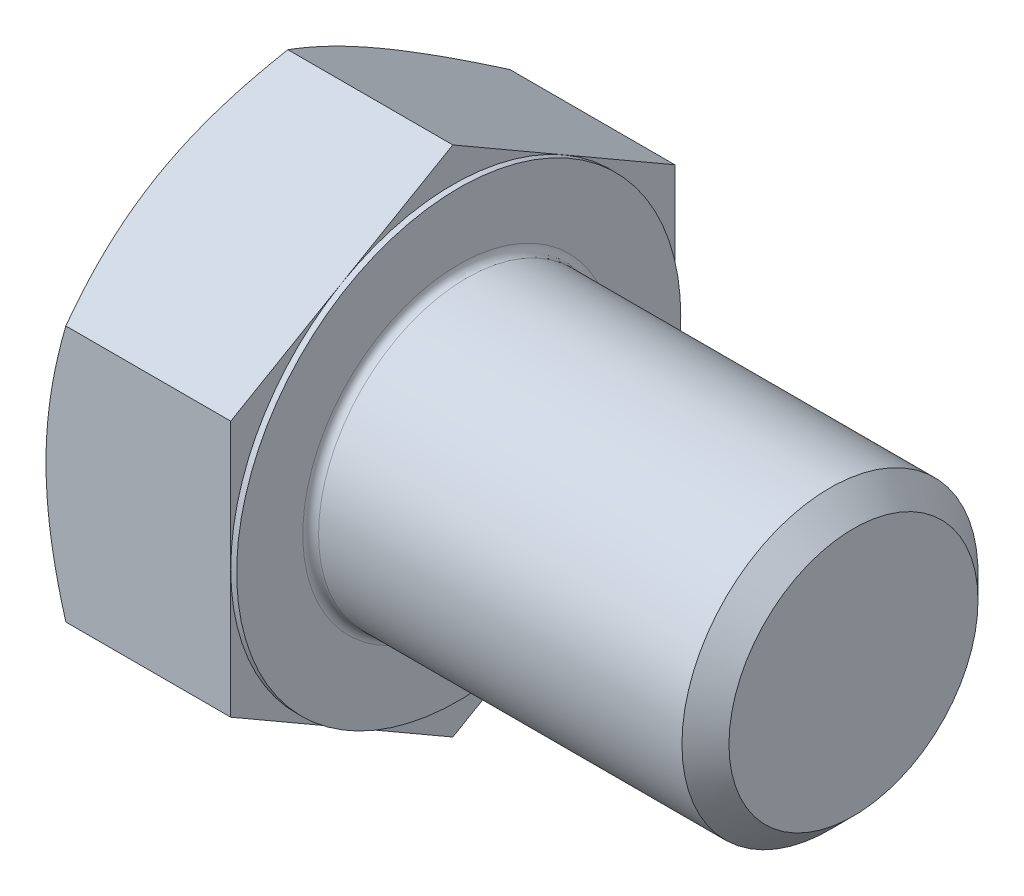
ISO-10303-21;
HEADER;
FILE_DESCRIPTION(('STEP AP214'),'2;1');
FILE_NAME('part.step','',(''),(''),'','','');
FILE_SCHEMA(('AUTOMOTIVE_DESIGN { 1 0 10303 214 1 1 1 1 }'));
ENDSEC;
DATA;
#1=APPLICATION_CONTEXT('core data for automotive mechanical design processes');
#2=APPLICATION_PROTOCOL_DEFINITION('international standard','automotive_design',2000,#1);
#3=PRODUCT_CONTEXT('',#1,'mechanical');
#4=PRODUCT('Part','Part','',(#3));
#5=PRODUCT_RELATED_PRODUCT_CATEGORY('part','',(#4));
#6=PRODUCT_DEFINITION_FORMATION('','',#4);
#7=PRODUCT_DEFINITION_CONTEXT('part definition',#1,'design');
#8=PRODUCT_DEFINITION('design','',#6,#7);
#9=PRODUCT_DEFINITION_SHAPE('','',#8);
#10=(LENGTH_UNIT() NAMED_UNIT(*) SI_UNIT(.MILLI.,.METRE.));
#11=(NAMED_UNIT(*) PLANE_ANGLE_UNIT() SI_UNIT($,.RADIAN.));
#12=(NAMED_UNIT(*) SI_UNIT($,.STERADIAN.) SOLID_ANGLE_UNIT());
#13=UNCERTAINTY_MEASURE_WITH_UNIT(LENGTH_MEASURE(1.E-05),#10,'distance_accuracy_value','');
#14=(GEOMETRIC_REPRESENTATION_CONTEXT(3) GLOBAL_UNCERTAINTY_ASSIGNED_CONTEXT((#13)) GLOBAL_UNIT_ASSIGNED_CONTEXT((#10,
#11,#12)) REPRESENTATION_CONTEXT('',''));
#15=CARTESIAN_POINT('',(0.,0.,0.));
#16=DIRECTION('',(0.,0.,1.));
#17=DIRECTION('',(1.,0.,0.));
#18=AXIS2_PLACEMENT_3D('',#15,#16,#17);
#19=CARTESIAN_POINT('',(12.2682,16.4977839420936,0.));
#20=DIRECTION('',(1.,0.,0.));
#21=DIRECTION('',(0.,0.,-1.));
#22=AXIS2_PLACEMENT_3D('',#19,#20,#21);
#23=PLANE('',#22);
#24=CARTESIAN_POINT('',(12.2682,0.,0.));
#25=DIRECTION('',(1.,0.,0.));
#26=DIRECTION('',(0.,0.,-1.));
#27=AXIS2_PLACEMENT_3D('',#24,#25,#26);
#28=CIRCLE('',#27,10.033);
#29=CARTESIAN_POINT('',(12.2682,0.,-10.033));
#30=VERTEX_POINT('',#29);
#31=EDGE_CURVE('E40',#30,#30,#28,.F.);
#32=ORIENTED_EDGE('',*,*,#31,.T.);
#33=EDGE_LOOP('',(#32));
#34=FACE_BOUND('',#33,.T.);
#35=CARTESIAN_POINT('',(12.2682,0.,0.));
#36=DIRECTION('',(1.,0.,0.));
#37=DIRECTION('',(0.,0.,-1.));
#38=AXIS2_PLACEMENT_3D('',#35,#36,#37);
#39=CIRCLE('',#38,14.2875);
#40=CARTESIAN_POINT('',(12.2682,0.,-14.2875));
#41=VERTEX_POINT('',#40);
#42=EDGE_CURVE('E297',#41,#41,#39,.T.);
#43=ORIENTED_EDGE('',*,*,#42,.T.);
#44=EDGE_LOOP('',(#43));
#45=FACE_BOUND('',#44,.T.);
#46=ADVANCED_FACE('F32',(#34,#45),#23,.T.);
#47=CARTESIAN_POINT('',(0.,0.,0.));
#48=DIRECTION('',(-1.,0.,0.));
#49=DIRECTION('',(0.,0.,1.));
#50=AXIS2_PLACEMENT_3D('',#47,#48,#49);
#51=CYLINDRICAL_SURFACE('',#50,9.525);
#52=CARTESIAN_POINT('',(12.7762,0.,0.));
#53=DIRECTION('',(1.,0.,0.));
#54=DIRECTION('',(0.,0.,-1.));
#55=AXIS2_PLACEMENT_3D('',#52,#53,#54);
#56=CIRCLE('',#55,9.525);
#57=CARTESIAN_POINT('',(12.7762,0.,-9.525));
#58=VERTEX_POINT('',#57);
#59=EDGE_CURVE('E11',#58,#58,#56,.T.);
#60=ORIENTED_EDGE('',*,*,#59,.T.);
#61=EDGE_LOOP('',(#60));
#62=FACE_BOUND('',#61,.T.);
#63=CARTESIAN_POINT('',(36.15563,0.,0.));
#64=DIRECTION('',(-1.,0.,0.));
#65=DIRECTION('',(0.,0.,1.));
#66=AXIS2_PLACEMENT_3D('',#63,#64,#65);
#67=CIRCLE('',#66,9.525);
#68=CARTESIAN_POINT('',(36.15563,0.,9.525));
#69=VERTEX_POINT('',#68);
#70=EDGE_CURVE('E276',#69,#69,#67,.T.);
#71=ORIENTED_EDGE('',*,*,#70,.T.);
#72=EDGE_LOOP('',(#71));
#73=FACE_BOUND('',#72,.T.);
#74=ADVANCED_FACE('F250',(#62,#73),#51,.T.);
#75=CARTESIAN_POINT('',(37.6682,0.,0.));
#76=DIRECTION('',(-1.,0.,0.));
#77=DIRECTION('',(0.,0.,1.));
#78=AXIS2_PLACEMENT_3D('',#75,#76,#77);
#79=CONICAL_SURFACE('',#78,8.01243,0.785398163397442);
#80=ORIENTED_EDGE('',*,*,#70,.F.);
#81=EDGE_LOOP('',(#80));
#82=FACE_BOUND('',#81,.T.);
#83=CARTESIAN_POINT('',(37.6682,0.,0.));
#84=DIRECTION('',(-1.,0.,0.));
#85=DIRECTION('',(0.,0.,1.));
#86=AXIS2_PLACEMENT_3D('',#83,#84,#85);
#87=CIRCLE('',#86,8.01243);
#88=CARTESIAN_POINT('',(37.6682,0.,8.01243));
#89=VERTEX_POINT('',#88);
#90=EDGE_CURVE('E274',#89,#89,#87,.T.);
#91=ORIENTED_EDGE('',*,*,#90,.T.);
#92=EDGE_LOOP('',(#91));
#93=FACE_BOUND('',#92,.T.);
#94=ADVANCED_FACE('F255',(#82,#93),#79,.T.);
#95=CARTESIAN_POINT('',(37.6682,0.,0.));
#96=DIRECTION('',(-1.,0.,0.));
#97=DIRECTION('',(0.,0.,1.));
#98=AXIS2_PLACEMENT_3D('',#95,#96,#97);
#99=PLANE('',#98);
#100=ORIENTED_EDGE('',*,*,#90,.F.);
#101=EDGE_LOOP('',(#100));
#102=FACE_BOUND('',#101,.T.);
#103=ADVANCED_FACE('F262',(#102),#99,.F.);
#104=CARTESIAN_POINT('',(11.8872,14.2875,0.));
#105=DIRECTION('',(1.,0.,0.));
#106=DIRECTION('',(0.,0.,-1.));
#107=AXIS2_PLACEMENT_3D('',#104,#105,#106);
#108=PLANE('',#107);
#109=DIRECTION('',(0.,0.500000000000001,0.866025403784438));
#110=VECTOR('',#109,1.);
#111=CARTESIAN_POINT('',(11.8872,8.24889197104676,-14.2875));
#112=LINE('',#111,#110);
#113=CARTESIAN_POINT('',(11.8872,8.24889197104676,-14.2875));
#114=VERTEX_POINT('',#113);
#115=CARTESIAN_POINT('',(11.8872,12.3733379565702,-7.14375000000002));
#116=VERTEX_POINT('',#115);
#117=EDGE_CURVE('E164',#114,#116,#112,.T.);
#118=ORIENTED_EDGE('',*,*,#117,.T.);
#119=CARTESIAN_POINT('',(11.8872,0.,0.));
#120=DIRECTION('',(-1.,0.,0.));
#121=DIRECTION('',(0.,0.,1.));
#122=AXIS2_PLACEMENT_3D('',#119,#120,#121);
#123=CIRCLE('',#122,14.2875);
#124=CARTESIAN_POINT('',(11.8872,0.,-14.2875));
#125=VERTEX_POINT('',#124);
#126=EDGE_CURVE('E47',#116,#125,#123,.T.);
#127=ORIENTED_EDGE('',*,*,#126,.T.);
#128=DIRECTION('',(0.,1.,0.));
#129=VECTOR('',#128,1.);
#130=CARTESIAN_POINT('',(11.8872,8.24889197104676,-14.2875));
#131=LINE('',#130,#129);
#132=EDGE_CURVE('E300',#125,#114,#131,.T.);
#133=ORIENTED_EDGE('',*,*,#132,.T.);
#134=EDGE_LOOP('',(#118,#127,#133));
#135=FACE_BOUND('',#134,.T.);
#136=ADVANCED_FACE('F265',(#135),#108,.T.);
#137=CARTESIAN_POINT('',(11.8872,16.4977839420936,0.));
#138=VERTEX_POINT('',#137);
#139=EDGE_CURVE('E162',#116,#138,#112,.T.);
#140=ORIENTED_EDGE('',*,*,#139,.T.);
#141=DIRECTION('',(0.,-0.500000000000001,0.866025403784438));
#142=VECTOR('',#141,1.);
#143=CARTESIAN_POINT('',(11.8872,16.4977839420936,0.));
#144=LINE('',#143,#142);
#145=CARTESIAN_POINT('',(11.8872,12.3733379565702,7.14375000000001));
#146=VERTEX_POINT('',#145);
#147=EDGE_CURVE('E161',#138,#146,#144,.T.);
#148=ORIENTED_EDGE('',*,*,#147,.T.);
#149=EDGE_CURVE('E150',#146,#116,#123,.T.);
#150=ORIENTED_EDGE('',*,*,#149,.T.);
#151=EDGE_LOOP('',(#140,#148,#150));
#152=FACE_BOUND('',#151,.T.);
#153=ADVANCED_FACE('F270',(#152),#108,.T.);
#154=CARTESIAN_POINT('',(11.8872,8.24889197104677,14.2875));
#155=VERTEX_POINT('',#154);
#156=EDGE_CURVE('E129',#146,#155,#144,.T.);
#157=ORIENTED_EDGE('',*,*,#156,.T.);
#158=DIRECTION('',(0.,-1.,0.));
#159=VECTOR('',#158,1.);
#160=CARTESIAN_POINT('',(11.8872,8.24889197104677,14.2875));
#161=LINE('',#160,#159);
#162=CARTESIAN_POINT('',(11.8872,0.,14.2875));
#163=VERTEX_POINT('',#162);
#164=EDGE_CURVE('E123',#155,#163,#161,.T.);
#165=ORIENTED_EDGE('',*,*,#164,.T.);
#166=EDGE_CURVE('E127',#163,#146,#123,.T.);
#167=ORIENTED_EDGE('',*,*,#166,.T.);
#168=EDGE_LOOP('',(#157,#165,#167));
#169=FACE_BOUND('',#168,.T.);
#170=ADVANCED_FACE('F125',(#169),#108,.T.);
#171=CARTESIAN_POINT('',(11.8872,-8.24889197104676,14.2875));
#172=VERTEX_POINT('',#171);
#173=EDGE_CURVE('E133',#163,#172,#161,.T.);
#174=ORIENTED_EDGE('',*,*,#173,.T.);
#175=DIRECTION('',(0.,-0.500000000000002,-0.866025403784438));
#176=VECTOR('',#175,1.);
#177=CARTESIAN_POINT('',(11.8872,-16.4977839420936,0.));
#178=LINE('',#177,#176);
#179=CARTESIAN_POINT('',(11.8872,-12.3733379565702,7.14375000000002));
#180=VERTEX_POINT('',#179);
#181=EDGE_CURVE('E140',#172,#180,#178,.T.);
#182=ORIENTED_EDGE('',*,*,#181,.T.);
#183=EDGE_CURVE('E137',#180,#163,#123,.T.);
#184=ORIENTED_EDGE('',*,*,#183,.T.);
#185=EDGE_LOOP('',(#174,#182,#184));
#186=FACE_BOUND('',#185,.T.);
#187=ADVANCED_FACE('F138',(#186),#108,.T.);
#188=CARTESIAN_POINT('',(11.8872,-16.4977839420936,0.));
#189=VERTEX_POINT('',#188);
#190=EDGE_CURVE('E156',#180,#189,#178,.T.);
#191=ORIENTED_EDGE('',*,*,#190,.T.);
#192=DIRECTION('',(0.,0.5,-0.866025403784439));
#193=VECTOR('',#192,1.);
#194=CARTESIAN_POINT('',(11.8872,-8.2488919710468,-14.2875));
#195=LINE('',#194,#193);
#196=CARTESIAN_POINT('',(11.8872,-12.3733379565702,-7.14375));
#197=VERTEX_POINT('',#196);
#198=EDGE_CURVE('E338',#189,#197,#195,.T.);
#199=ORIENTED_EDGE('',*,*,#198,.T.);
#200=EDGE_CURVE('E144',#197,#180,#123,.T.);
#201=ORIENTED_EDGE('',*,*,#200,.T.);
#202=EDGE_LOOP('',(#191,#199,#201));
#203=FACE_BOUND('',#202,.T.);
#204=ADVANCED_FACE('F339',(#203),#108,.T.);
#205=CARTESIAN_POINT('',(11.8872,-8.2488919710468,-14.2875));
#206=VERTEX_POINT('',#205);
#207=EDGE_CURVE('E151',#197,#206,#195,.T.);
#208=ORIENTED_EDGE('',*,*,#207,.T.);
#209=EDGE_CURVE('E301',#206,#125,#131,.T.);
#210=ORIENTED_EDGE('',*,*,#209,.T.);
#211=EDGE_CURVE('E308',#125,#197,#123,.T.);
#212=ORIENTED_EDGE('',*,*,#211,.T.);
#213=EDGE_LOOP('',(#208,#210,#212));
#214=FACE_BOUND('',#213,.T.);
#215=ADVANCED_FACE('F271',(#214),#108,.T.);
#216=CARTESIAN_POINT('',(0.,0.,0.));
#217=DIRECTION('',(-1.,0.,0.));
#218=DIRECTION('',(0.,0.,1.));
#219=AXIS2_PLACEMENT_3D('',#216,#217,#218);
#220=CYLINDRICAL_SURFACE('',#219,14.2875);
#221=ORIENTED_EDGE('',*,*,#126,.F.);
#222=ORIENTED_EDGE('',*,*,#149,.F.);
#223=ORIENTED_EDGE('',*,*,#166,.F.);
#224=ORIENTED_EDGE('',*,*,#183,.F.);
#225=ORIENTED_EDGE('',*,*,#200,.F.);
#226=ORIENTED_EDGE('',*,*,#211,.F.);
#227=EDGE_LOOP('',(#221,#222,#223,#224,#225,#226));
#228=FACE_BOUND('',#227,.T.);
#229=ORIENTED_EDGE('',*,*,#42,.F.);
#230=EDGE_LOOP('',(#229));
#231=FACE_BOUND('',#230,.T.);
#232=ADVANCED_FACE('F147',(#228,#231),#220,.T.);
#233=CARTESIAN_POINT('',(0.,16.4977839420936,0.));
#234=DIRECTION('',(1.,0.,0.));
#235=DIRECTION('',(0.,0.,-1.));
#236=AXIS2_PLACEMENT_3D('',#233,#234,#235);
#237=PLANE('',#236);
#238=CARTESIAN_POINT('',(0.,0.,0.));
#239=DIRECTION('',(1.,0.,0.));
#240=DIRECTION('',(0.,0.,-1.));
#241=AXIS2_PLACEMENT_3D('',#238,#239,#240);
#242=CIRCLE('',#241,14.2875);
#243=CARTESIAN_POINT('',(0.,0.,-14.2875));
#244=VERTEX_POINT('',#243);
#245=CARTESIAN_POINT('',(0.,12.3733379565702,-7.14375000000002));
#246=VERTEX_POINT('',#245);
#247=EDGE_CURVE('E296',#244,#246,#242,.T.);
#248=ORIENTED_EDGE('',*,*,#247,.F.);
#249=CARTESIAN_POINT('',(0.,-12.3733379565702,-7.14375));
#250=VERTEX_POINT('',#249);
#251=EDGE_CURVE('E292',#250,#244,#242,.T.);
#252=ORIENTED_EDGE('',*,*,#251,.F.);
#253=CARTESIAN_POINT('',(0.,-12.3733379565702,7.14375000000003));
#254=VERTEX_POINT('',#253);
#255=EDGE_CURVE('E295',#254,#250,#242,.T.);
#256=ORIENTED_EDGE('',*,*,#255,.F.);
#257=CARTESIAN_POINT('',(0.,0.,14.2875));
#258=VERTEX_POINT('',#257);
#259=EDGE_CURVE('E331',#258,#254,#242,.T.);
#260=ORIENTED_EDGE('',*,*,#259,.F.);
#261=CARTESIAN_POINT('',(0.,0.,0.));
#262=DIRECTION('',(-1.,0.,0.));
#263=DIRECTION('',(0.,0.,1.));
#264=AXIS2_PLACEMENT_3D('',#261,#262,#263);
#265=CIRCLE('',#264,14.2875);
#266=CARTESIAN_POINT('',(0.,12.3733379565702,7.14375000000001));
#267=VERTEX_POINT('',#266);
#268=EDGE_CURVE('E165',#258,#267,#265,.T.);
#269=ORIENTED_EDGE('',*,*,#268,.T.);
#270=EDGE_CURVE('E354',#246,#267,#242,.T.);
#271=ORIENTED_EDGE('',*,*,#270,.F.);
#272=EDGE_LOOP('',(#248,#252,#256,#260,#269,#271));
#273=FACE_BOUND('',#272,.T.);
#274=ADVANCED_FACE('F196',(#273),#237,.F.);
#275=CARTESIAN_POINT('',(0.,0.,0.));
#276=DIRECTION('',(1.,0.,0.));
#277=DIRECTION('',(0.,0.,-1.));
#278=AXIS2_PLACEMENT_3D('',#275,#276,#277);
#279=CONICAL_SURFACE('',#278,14.2875,1.0471975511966);
#280=CARTESIAN_POINT('',(1.27617469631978,8.24877650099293,14.2877));
#281=CARTESIAN_POINT('',(1.17150354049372,8.43008395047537,13.9736662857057));
#282=CARTESIAN_POINT('',(1.07158215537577,8.61209859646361,13.6584076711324));
#283=CARTESIAN_POINT('',(0.882559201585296,8.97758743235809,13.025362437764));
#284=CARTESIAN_POINT('',(0.793461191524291,9.16106208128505,12.7075750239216));
#285=CARTESIAN_POINT('',(0.62728264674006,9.52982551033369,12.068858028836));
#286=CARTESIAN_POINT('',(0.550230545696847,9.71511751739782,11.7479228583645));
#287=CARTESIAN_POINT('',(0.409798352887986,10.0869890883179,11.1038224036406));
#288=CARTESIAN_POINT('',(0.346417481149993,10.2735685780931,10.7806572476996));
#289=CARTESIAN_POINT('',(0.236023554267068,10.6432342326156,10.1403775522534));
#290=CARTESIAN_POINT('',(0.188645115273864,10.8262929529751,9.82331054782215));
#291=CARTESIAN_POINT('',(0.109201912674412,11.1932492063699,9.1877236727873));
#292=CARTESIAN_POINT('',(0.0771374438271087,11.3771467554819,8.86920377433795));
#293=CARTESIAN_POINT('',(0.0291317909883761,11.7452507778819,8.23162890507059));
#294=CARTESIAN_POINT('',(0.0131714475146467,11.9294566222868,7.91257502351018));
#295=CARTESIAN_POINT('',(-0.00228271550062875,12.2980383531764,7.27417273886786));
#296=CARTESIAN_POINT('',(-0.00177704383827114,12.4824142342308,6.95482434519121));
#297=CARTESIAN_POINT('',(0.0145506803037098,12.8271039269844,6.35780428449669));
#298=CARTESIAN_POINT('',(0.0283811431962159,12.9874423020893,6.08009007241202));
#299=CARTESIAN_POINT('',(0.0682339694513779,13.3077502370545,5.52530045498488));
#300=CARTESIAN_POINT('',(0.0942571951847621,13.4677197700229,5.24822509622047));
#301=CARTESIAN_POINT('',(0.158041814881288,13.7872031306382,4.69486368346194));
#302=CARTESIAN_POINT('',(0.195812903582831,13.9467164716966,4.41857847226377));
#303=CARTESIAN_POINT('',(0.282430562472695,14.2649953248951,3.86730332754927));
#304=CARTESIAN_POINT('',(0.331277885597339,14.4237607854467,3.59231348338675));
#305=CARTESIAN_POINT('',(0.495669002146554,14.9057021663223,2.75756652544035));
#306=CARTESIAN_POINT('',(0.627604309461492,15.2274824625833,2.20022670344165));
#307=CARTESIAN_POINT('',(0.927043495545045,15.8662449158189,1.0938576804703));
#308=CARTESIAN_POINT('',(1.09447704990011,16.1832352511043,0.544814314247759));
#309=CARTESIAN_POINT('',(1.27617469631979,16.4978994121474,-0.000200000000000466));
#310=B_SPLINE_CURVE_WITH_KNOTS('',3,(#280,#281,#282,#283,#284,#285,#286,#287,#288,#289,#290,
#291,#292,#293,#294,#295,#296,#297,#298,#299,#300,#301,#302,#303,#304,#305,#306,#307,#308,#309),
.UNSPECIFIED.,.F.,.F.,(4,2,2,2,2,2,2,2,2,2,2,2,2,2,4),(0.,1.1322886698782,2.26494862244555,
3.4002430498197,4.53547268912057,5.64268215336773,6.74991292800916,7.85582484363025,
8.96170258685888,9.92439507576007,10.8871556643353,11.8507128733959,12.8143356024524,
14.7839571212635,16.7497125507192),.UNSPECIFIED.);
#311=CARTESIAN_POINT('',(1.27610802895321,16.4977839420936,0.));
#312=VERTEX_POINT('',#311);
#313=EDGE_CURVE('E216',#267,#312,#310,.T.);
#314=ORIENTED_EDGE('',*,*,#313,.T.);
#315=CARTESIAN_POINT('',(1.27617469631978,16.4978994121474,0.00020000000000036));
#316=CARTESIAN_POINT('',(1.17150354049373,16.316591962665,-0.313833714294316));
#317=CARTESIAN_POINT('',(1.07158215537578,16.1345773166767,-0.629092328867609));
#318=CARTESIAN_POINT('',(0.882559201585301,15.7690884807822,-1.26213756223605));
#319=CARTESIAN_POINT('',(0.793461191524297,15.5856138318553,-1.5799249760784));
#320=CARTESIAN_POINT('',(0.627282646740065,15.2168504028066,-2.21864197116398));
#321=CARTESIAN_POINT('',(0.55023054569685,15.0315583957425,-2.53957714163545));
#322=CARTESIAN_POINT('',(0.409798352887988,14.6596868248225,-3.18367759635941));
#323=CARTESIAN_POINT('',(0.346417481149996,14.4731073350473,-3.50684275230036));
#324=CARTESIAN_POINT('',(0.23602355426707,14.1034416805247,-4.14712244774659));
#325=CARTESIAN_POINT('',(0.188645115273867,13.9203829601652,-4.46418945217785));
#326=CARTESIAN_POINT('',(0.109201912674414,13.5534267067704,-5.0997763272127));
#327=CARTESIAN_POINT('',(0.0771374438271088,13.3695291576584,-5.41829622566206));
#328=CARTESIAN_POINT('',(0.029131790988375,13.0014251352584,-6.05587109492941));
#329=CARTESIAN_POINT('',(0.0131714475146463,12.8172192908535,-6.37492497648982));
#330=CARTESIAN_POINT('',(-0.0022827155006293,12.448637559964,-7.01332726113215));
#331=CARTESIAN_POINT('',(-0.00177704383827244,12.2642616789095,-7.3326756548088));
#332=CARTESIAN_POINT('',(0.0145506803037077,11.9195719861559,-7.92969571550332));
#333=CARTESIAN_POINT('',(0.0283811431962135,11.759233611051,-8.20740992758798));
#334=CARTESIAN_POINT('',(0.0682339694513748,11.4389256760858,-8.76219954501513));
#335=CARTESIAN_POINT('',(0.0942571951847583,11.2789561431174,-9.03927490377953));
#336=CARTESIAN_POINT('',(0.158041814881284,10.9594727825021,-9.59263631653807));
#337=CARTESIAN_POINT('',(0.195812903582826,10.7999594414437,-9.86892152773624));
#338=CARTESIAN_POINT('',(0.28243056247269,10.4816805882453,-10.4201966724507));
#339=CARTESIAN_POINT('',(0.331277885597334,10.3229151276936,-10.6951865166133));
#340=CARTESIAN_POINT('',(0.495669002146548,9.84097374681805,-11.5299334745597));
#341=CARTESIAN_POINT('',(0.627604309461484,9.519193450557,-12.0872732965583));
#342=CARTESIAN_POINT('',(0.927043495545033,8.88043099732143,-13.1936423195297));
#343=CARTESIAN_POINT('',(1.0944770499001,8.56344066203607,-13.7426856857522));
#344=CARTESIAN_POINT('',(1.27617469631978,8.24877650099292,-14.2877));
#345=B_SPLINE_CURVE_WITH_KNOTS('',3,(#315,#316,#317,#318,#319,#320,#321,#322,#323,#324,#325,
#326,#327,#328,#329,#330,#331,#332,#333,#334,#335,#336,#337,#338,#339,#340,#341,#342,#343,#344),
.UNSPECIFIED.,.F.,.F.,(4,2,2,2,2,2,2,2,2,2,2,2,2,2,4),(0.,1.1322886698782,2.26494862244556,
3.4002430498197,4.53547268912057,5.64268215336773,6.74991292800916,7.85582484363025,
8.96170258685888,9.92439507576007,10.8871556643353,11.8507128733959,12.8143356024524,
14.7839571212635,16.7497125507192),.UNSPECIFIED.);
#346=EDGE_CURVE('E55',#312,#246,#345,.T.);
#347=ORIENTED_EDGE('',*,*,#346,.T.);
#348=ORIENTED_EDGE('',*,*,#270,.T.);
#349=EDGE_LOOP('',(#314,#347,#348));
#350=FACE_BOUND('',#349,.T.);
#351=ADVANCED_FACE('F355',(#350),#279,.T.);
#352=CARTESIAN_POINT('',(7.08559652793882,-22.3898851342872,14.2875));
#353=CARTESIAN_POINT('',(6.93326774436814,-22.0768961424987,14.2875));
#354=CARTESIAN_POINT('',(6.78168115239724,-21.7635461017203,14.2875));
#355=CARTESIAN_POINT('',(6.48015999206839,-21.1360486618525,14.2875));
#356=CARTESIAN_POINT('',(6.33022543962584,-20.8219012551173,14.2875));
#357=CARTESIAN_POINT('',(5.88311326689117,-19.8780695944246,14.2875));
#358=CARTESIAN_POINT('',(5.58867058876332,-19.2470849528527,14.2875));
#359=CARTESIAN_POINT('',(5.00727921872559,-17.9776461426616,14.2875));
#360=CARTESIAN_POINT('',(4.72037808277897,-17.3391701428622,14.2875));
#361=CARTESIAN_POINT('',(4.15800525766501,-16.0572214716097,14.2875));
#362=CARTESIAN_POINT('',(3.88253304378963,-15.4137490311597,14.2875));
#363=CARTESIAN_POINT('',(3.33703966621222,-14.0991063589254,14.2875));
#364=CARTESIAN_POINT('',(3.06751086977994,-13.4277307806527,14.2875));
#365=CARTESIAN_POINT('',(2.54829414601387,-12.077206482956,14.2875));
#366=CARTESIAN_POINT('',(2.29860841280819,-11.3980569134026,14.2875));
#367=CARTESIAN_POINT('',(1.82546713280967,-10.0321237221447,14.2875));
#368=CARTESIAN_POINT('',(1.60196042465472,-9.34535796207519,14.2875));
#369=CARTESIAN_POINT('',(1.18818152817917,-7.96191308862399,14.2875));
#370=CARTESIAN_POINT('',(0.997899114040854,-7.26523709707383,14.2875));
#371=CARTESIAN_POINT('',(0.744688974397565,-6.21459800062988,14.2875));
#372=CARTESIAN_POINT('',(0.665833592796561,-5.86445181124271,14.2875));
#373=CARTESIAN_POINT('',(0.519775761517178,-5.16172478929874,14.2875));
#374=CARTESIAN_POINT('',(0.452573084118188,-4.80914400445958,14.2875));
#375=CARTESIAN_POINT('',(0.330991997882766,-4.10177331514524,14.2875));
#376=CARTESIAN_POINT('',(0.276613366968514,-3.74698344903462,14.2875));
#377=CARTESIAN_POINT('',(0.181756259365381,-3.03555342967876,14.2875));
#378=CARTESIAN_POINT('',(0.141277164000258,-2.67891335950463,14.2875));
#379=CARTESIAN_POINT('',(0.0755436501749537,-1.96903610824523,14.2875));
#380=CARTESIAN_POINT('',(0.0500928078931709,-1.61581722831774,14.2875));
#381=CARTESIAN_POINT('',(0.0141622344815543,-0.908619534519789,14.2875));
#382=CARTESIAN_POINT('',(0.00368224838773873,-0.554640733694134,14.2875));
#383=CARTESIAN_POINT('',(-0.00205625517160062,0.153442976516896,14.2875));
#384=CARTESIAN_POINT('',(0.00268522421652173,0.507547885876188,14.2875));
#385=CARTESIAN_POINT('',(0.0272712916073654,1.21523734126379,14.2875));
#386=CARTESIAN_POINT('',(0.0471165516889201,1.56882186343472,14.2875));
#387=CARTESIAN_POINT('',(0.111996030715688,2.41165837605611,14.2875));
#388=CARTESIAN_POINT('',(0.163810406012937,2.90039810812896,14.2875));
#389=CARTESIAN_POINT('',(0.293528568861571,3.87440480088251,14.2875));
#390=CARTESIAN_POINT('',(0.371435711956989,4.35967130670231,14.2875));
#391=CARTESIAN_POINT('',(0.550568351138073,5.32621624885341,14.2875));
#392=CARTESIAN_POINT('',(0.651811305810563,5.80749141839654,14.2875));
#393=CARTESIAN_POINT('',(0.874513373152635,6.76529068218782,14.2875));
#394=CARTESIAN_POINT('',(0.99597223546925,7.24181483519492,14.2875));
#395=CARTESIAN_POINT('',(1.25905167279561,8.20075205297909,14.2875));
#396=CARTESIAN_POINT('',(1.40106388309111,8.68305692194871,14.2875));
#397=CARTESIAN_POINT('',(1.70023403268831,9.64291928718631,14.2875));
#398=CARTESIAN_POINT('',(1.85739207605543,10.1204767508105,14.2875));
#399=CARTESIAN_POINT('',(2.18431745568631,11.0710723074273,14.2875));
#400=CARTESIAN_POINT('',(2.35408093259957,11.5441117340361,14.2875));
#401=CARTESIAN_POINT('',(2.704173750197,12.4862394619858,14.2875));
#402=CARTESIAN_POINT('',(2.88450294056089,12.9553278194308,14.2875));
#403=CARTESIAN_POINT('',(3.33642274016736,14.0985450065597,14.2875));
#404=CARTESIAN_POINT('',(3.61283070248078,14.7707670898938,14.2875));
#405=CARTESIAN_POINT('',(4.17998789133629,16.1091534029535,14.2875));
#406=CARTESIAN_POINT('',(4.47073817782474,16.775317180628,14.2875));
#407=CARTESIAN_POINT('',(5.06358549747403,18.1027741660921,14.2875));
#408=CARTESIAN_POINT('',(5.36568552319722,18.7640660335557,14.2875));
#409=CARTESIAN_POINT('',(5.97884037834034,20.0824528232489,14.2875));
#410=CARTESIAN_POINT('',(6.28989497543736,20.7395478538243,14.2875));
#411=CARTESIAN_POINT('',(6.91960732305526,22.0510812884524,14.2875));
#412=CARTESIAN_POINT('',(7.2382740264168,22.7055153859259,14.2875));
#413=CARTESIAN_POINT('',(7.88149355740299,24.0114843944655,14.2875));
#414=CARTESIAN_POINT('',(8.20604641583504,24.6630192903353,14.2875));
#415=CARTESIAN_POINT('',(8.85994319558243,25.9635553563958,14.2875));
#416=CARTESIAN_POINT('',(9.1892863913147,26.6125568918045,14.2875));
#417=CARTESIAN_POINT('',(9.85199752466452,27.9084978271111,14.2875));
#418=CARTESIAN_POINT('',(10.1853654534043,28.5554372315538,14.2875));
#419=CARTESIAN_POINT('',(11.1306522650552,30.3782153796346,14.2875));
#420=CARTESIAN_POINT('',(11.7464658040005,31.5520342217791,14.2875));
#421=CARTESIAN_POINT('',(12.9863637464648,33.8953480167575,14.2875));
#422=CARTESIAN_POINT('',(13.6104484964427,35.0648427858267,14.2875));
#423=CARTESIAN_POINT('',(14.8631697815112,37.3972192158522,14.2875));
#424=CARTESIAN_POINT('',(15.4917889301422,38.5601102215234,14.2875));
#425=CARTESIAN_POINT('',(16.4383496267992,40.3024250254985,14.2875));
#426=CARTESIAN_POINT('',(16.7544655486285,40.8828421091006,14.2875));
#427=CARTESIAN_POINT('',(17.3877853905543,42.0430813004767,14.2875));
#428=CARTESIAN_POINT('',(17.7049893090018,42.6229034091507,14.2875));
#429=CARTESIAN_POINT('',(18.0226732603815,43.2024624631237,14.2875));
#430=B_SPLINE_CURVE_WITH_KNOTS('',3,(#352,#353,#354,#355,#356,#357,#358,#359,#360,#361,#362,
#363,#364,#365,#366,#367,#368,#369,#370,#371,#372,#373,#374,#375,#376,#377,#378,#379,#380,#381,
#382,#383,#384,#385,#386,#387,#388,#389,#390,#391,#392,#393,#394,#395,#396,#397,#398,#399,#400,
#401,#402,#403,#404,#405,#406,#407,#408,#409,#410,#411,#412,#413,#414,#415,#416,#417,#418,#419,
#420,#421,#422,#423,#424,#425,#426,#427,#428,#429),.UNSPECIFIED.,.F.,.F.,(4,2,2,2,2,2,2,2,2,2,2,
2,2,2,2,2,2,2,2,2,2,2,2,2,2,2,2,2,2,2,2,2,2,2,2,2,2,2,4),(0.,1.0442661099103,2.08854227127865,
4.17739185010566,6.27722701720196,8.37696567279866,10.5470989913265,12.7174719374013,
14.8835299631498,17.0489201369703,18.1255049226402,19.2020686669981,20.2786137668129,
21.355110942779,22.4172072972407,23.479285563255,24.5413636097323,25.603488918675,
27.0771146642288,28.5509299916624,30.0258515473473,31.5007548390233,33.0087918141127,
34.5168391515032,36.0244266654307,37.5319927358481,39.7122554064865,41.8926794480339,
44.0736824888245,46.2546289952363,48.4382808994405,50.621944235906,52.805280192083,
54.9886113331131,58.9652043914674,62.9419645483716,66.9077143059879,68.8904689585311,
70.8732206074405),.UNSPECIFIED.);
#431=CARTESIAN_POINT('',(1.2761080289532,8.24889197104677,14.2875));
#432=VERTEX_POINT('',#431);
#433=EDGE_CURVE('E230',#258,#432,#430,.T.);
#434=ORIENTED_EDGE('',*,*,#433,.T.);
#435=EDGE_CURVE('E229',#432,#267,#310,.T.);
#436=ORIENTED_EDGE('',*,*,#435,.T.);
#437=ORIENTED_EDGE('',*,*,#268,.F.);
#438=EDGE_LOOP('',(#434,#436,#437));
#439=FACE_BOUND('',#438,.T.);
#440=ADVANCED_FACE('F325',(#439),#279,.T.);
#441=CARTESIAN_POINT('',(1.2761080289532,-8.24889197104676,14.2875));
#442=VERTEX_POINT('',#441);
#443=EDGE_CURVE('E277',#442,#258,#430,.T.);
#444=ORIENTED_EDGE('',*,*,#443,.T.);
#445=ORIENTED_EDGE('',*,*,#259,.T.);
#446=CARTESIAN_POINT('',(1.27617469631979,-16.4978994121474,-0.000200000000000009));
#447=CARTESIAN_POINT('',(1.17150354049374,-16.316591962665,0.313833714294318));
#448=CARTESIAN_POINT('',(1.07158215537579,-16.1345773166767,0.629092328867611));
#449=CARTESIAN_POINT('',(0.882559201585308,-15.7690884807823,1.26213756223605));
#450=CARTESIAN_POINT('',(0.793461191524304,-15.5856138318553,1.5799249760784));
#451=CARTESIAN_POINT('',(0.627282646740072,-15.2168504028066,2.21864197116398));
#452=CARTESIAN_POINT('',(0.550230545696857,-15.0315583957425,2.53957714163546));
#453=CARTESIAN_POINT('',(0.409798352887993,-14.6596868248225,3.18367759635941));
#454=CARTESIAN_POINT('',(0.34641748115,-14.4731073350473,3.50684275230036));
#455=CARTESIAN_POINT('',(0.236023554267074,-14.1034416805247,4.14712244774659));
#456=CARTESIAN_POINT('',(0.188645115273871,-13.9203829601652,4.46418945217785));
#457=CARTESIAN_POINT('',(0.109201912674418,-13.5534267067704,5.0997763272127));
#458=CARTESIAN_POINT('',(0.0771374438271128,-13.3695291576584,5.41829622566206));
#459=CARTESIAN_POINT('',(0.0291317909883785,-13.0014251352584,6.05587109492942));
#460=CARTESIAN_POINT('',(0.0131714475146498,-12.8172192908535,6.37492497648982));
#461=CARTESIAN_POINT('',(-0.00228271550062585,-12.448637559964,7.01332726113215));
#462=CARTESIAN_POINT('',(-0.00177704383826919,-12.2642616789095,7.3326756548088));
#463=CARTESIAN_POINT('',(0.0145506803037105,-11.9195719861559,7.92969571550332));
#464=CARTESIAN_POINT('',(0.028381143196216,-11.759233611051,8.20740992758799));
#465=CARTESIAN_POINT('',(0.0682339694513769,-11.4389256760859,8.76219954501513));
#466=CARTESIAN_POINT('',(0.0942571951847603,-11.2789561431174,9.03927490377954));
#467=CARTESIAN_POINT('',(0.158041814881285,-10.9594727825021,9.59263631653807));
#468=CARTESIAN_POINT('',(0.195812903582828,-10.7999594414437,9.86892152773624));
#469=CARTESIAN_POINT('',(0.282430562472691,-10.4816805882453,10.4201966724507));
#470=CARTESIAN_POINT('',(0.331277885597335,-10.3229151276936,10.6951865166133));
#471=CARTESIAN_POINT('',(0.495669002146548,-9.84097374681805,11.5299334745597));
#472=CARTESIAN_POINT('',(0.627604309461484,-9.519193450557,12.0872732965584));
#473=CARTESIAN_POINT('',(0.927043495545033,-8.88043099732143,13.1936423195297));
#474=CARTESIAN_POINT('',(1.0944770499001,-8.56344066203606,13.7426856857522));
#475=CARTESIAN_POINT('',(1.27617469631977,-8.24877650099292,14.2877));
#476=B_SPLINE_CURVE_WITH_KNOTS('',3,(#446,#447,#448,#449,#450,#451,#452,#453,#454,#455,#456,
#457,#458,#459,#460,#461,#462,#463,#464,#465,#466,#467,#468,#469,#470,#471,#472,#473,#474,#475),
.UNSPECIFIED.,.F.,.F.,(4,2,2,2,2,2,2,2,2,2,2,2,2,2,4),(0.,1.1322886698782,2.26494862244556,
3.4002430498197,4.53547268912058,5.64268215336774,6.74991292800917,7.85582484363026,
8.96170258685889,9.92439507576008,10.8871556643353,11.8507128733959,12.8143356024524,
14.7839571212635,16.7497125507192),.UNSPECIFIED.);
#477=EDGE_CURVE('E218',#254,#442,#476,.T.);
#478=ORIENTED_EDGE('',*,*,#477,.T.);
#479=EDGE_LOOP('',(#444,#445,#478));
#480=FACE_BOUND('',#479,.T.);
#481=ADVANCED_FACE('F185',(#480),#279,.T.);
#482=CARTESIAN_POINT('',(1.27610802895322,-16.4977839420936,0.));
#483=VERTEX_POINT('',#482);
#484=EDGE_CURVE('E210',#483,#254,#476,.T.);
#485=ORIENTED_EDGE('',*,*,#484,.T.);
#486=ORIENTED_EDGE('',*,*,#255,.T.);
#487=CARTESIAN_POINT('',(1.27617469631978,-8.24877650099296,-14.2877));
#488=CARTESIAN_POINT('',(1.17150354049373,-8.4300839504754,-13.9736662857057));
#489=CARTESIAN_POINT('',(1.07158215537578,-8.61209859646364,-13.6584076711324));
#490=CARTESIAN_POINT('',(0.882559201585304,-8.97758743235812,-13.025362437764));
#491=CARTESIAN_POINT('',(0.7934611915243,-9.16106208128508,-12.7075750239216));
#492=CARTESIAN_POINT('',(0.627282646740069,-9.52982551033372,-12.068858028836));
#493=CARTESIAN_POINT('',(0.550230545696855,-9.71511751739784,-11.7479228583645));
#494=CARTESIAN_POINT('',(0.409798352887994,-10.0869890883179,-11.1038224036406));
#495=CARTESIAN_POINT('',(0.346417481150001,-10.2735685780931,-10.7806572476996));
#496=CARTESIAN_POINT('',(0.236023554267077,-10.6432342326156,-10.1403775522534));
#497=CARTESIAN_POINT('',(0.188645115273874,-10.8262929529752,-9.82331054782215));
#498=CARTESIAN_POINT('',(0.109201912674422,-11.1932492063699,-9.1877236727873));
#499=CARTESIAN_POINT('',(0.0771374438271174,-11.3771467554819,-8.86920377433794));
#500=CARTESIAN_POINT('',(0.0291317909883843,-11.745250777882,-8.23162890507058));
#501=CARTESIAN_POINT('',(0.013171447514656,-11.9294566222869,-7.91257502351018));
#502=CARTESIAN_POINT('',(-0.00228271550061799,-12.2980383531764,-7.27417273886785));
#503=CARTESIAN_POINT('',(-0.00177704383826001,-12.4824142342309,-6.9548243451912));
#504=CARTESIAN_POINT('',(0.0145506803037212,-12.8271039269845,-6.35780428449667));
#505=CARTESIAN_POINT('',(0.0283811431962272,-12.9874423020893,-6.08009007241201));
#506=CARTESIAN_POINT('',(0.0682339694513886,-13.3077502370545,-5.52530045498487));
#507=CARTESIAN_POINT('',(0.0942571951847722,-13.4677197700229,-5.24822509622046));
#508=CARTESIAN_POINT('',(0.158041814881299,-13.7872031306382,-4.69486368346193));
#509=CARTESIAN_POINT('',(0.195812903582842,-13.9467164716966,-4.41857847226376));
#510=CARTESIAN_POINT('',(0.282430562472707,-14.2649953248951,-3.86730332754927));
#511=CARTESIAN_POINT('',(0.331277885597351,-14.4237607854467,-3.59231348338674));
#512=CARTESIAN_POINT('',(0.495669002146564,-14.9057021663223,-2.75756652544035));
#513=CARTESIAN_POINT('',(0.627604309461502,-15.2274824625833,-2.20022670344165));
#514=CARTESIAN_POINT('',(0.927043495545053,-15.8662449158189,-1.0938576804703));
#515=CARTESIAN_POINT('',(1.09447704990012,-16.1832352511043,-0.544814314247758));
#516=CARTESIAN_POINT('',(1.27617469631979,-16.4978994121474,0.000199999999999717));
#517=B_SPLINE_CURVE_WITH_KNOTS('',3,(#487,#488,#489,#490,#491,#492,#493,#494,#495,#496,#497,
#498,#499,#500,#501,#502,#503,#504,#505,#506,#507,#508,#509,#510,#511,#512,#513,#514,#515,#516),
.UNSPECIFIED.,.F.,.F.,(4,2,2,2,2,2,2,2,2,2,2,2,2,2,4),(0.,1.1322886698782,2.26494862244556,
3.4002430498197,4.53547268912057,5.64268215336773,6.74991292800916,7.85582484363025,
8.96170258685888,9.92439507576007,10.8871556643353,11.8507128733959,12.8143356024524,
14.7839571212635,16.7497125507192),.UNSPECIFIED.);
#518=EDGE_CURVE('E217',#250,#483,#517,.T.);
#519=ORIENTED_EDGE('',*,*,#518,.T.);
#520=EDGE_LOOP('',(#485,#486,#519));
#521=FACE_BOUND('',#520,.T.);
#522=ADVANCED_FACE('F353',(#521),#279,.T.);
#523=CARTESIAN_POINT('',(1.2761080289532,8.24889197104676,-14.2875));
#524=VERTEX_POINT('',#523);
#525=EDGE_CURVE('E219',#246,#524,#345,.T.);
#526=ORIENTED_EDGE('',*,*,#525,.T.);
#527=CARTESIAN_POINT('',(7.0855965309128,-22.3898851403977,-14.2875));
#528=CARTESIAN_POINT('',(6.9332677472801,-22.0768961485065,-14.2875));
#529=CARTESIAN_POINT('',(6.7816811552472,-21.7635461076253,-14.2875));
#530=CARTESIAN_POINT('',(6.48015999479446,-21.1360486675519,-14.2875));
#531=CARTESIAN_POINT('',(6.33022544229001,-20.8219012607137,-14.2875));
#532=CARTESIAN_POINT('',(5.88311326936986,-19.8780695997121,-14.2875));
#533=CARTESIAN_POINT('',(5.58867059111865,-19.2470849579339,-14.2875));
#534=CARTESIAN_POINT('',(5.00727922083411,-17.9776461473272,-14.2875));
#535=CARTESIAN_POINT('',(4.72037808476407,-17.3391701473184,-14.2875));
#536=CARTESIAN_POINT('',(4.15800525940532,-16.0572214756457,-14.2875));
#537=CARTESIAN_POINT('',(3.88253304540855,-15.4137490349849,-14.2875));
#538=CARTESIAN_POINT('',(3.33703966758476,-14.0991063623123,-14.2875));
#539=CARTESIAN_POINT('',(3.06751087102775,-13.427730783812,-14.2875));
#540=CARTESIAN_POINT('',(2.54829414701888,-12.0772064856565,-14.2875));
#541=CARTESIAN_POINT('',(2.29860841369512,-11.3980569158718,-14.2875));
#542=CARTESIAN_POINT('',(1.82546713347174,-10.0321237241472,-14.2875));
#543=CARTESIAN_POINT('',(1.60196042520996,-9.34535796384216,-14.2875));
#544=CARTESIAN_POINT('',(1.18818152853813,-7.96191308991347,-14.2875));
#545=CARTESIAN_POINT('',(0.997899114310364,-7.26523709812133,-14.2875));
#546=CARTESIAN_POINT('',(0.74468897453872,-6.21459800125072,-14.2875));
#547=CARTESIAN_POINT('',(0.665833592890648,-5.86445181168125,-14.2875));
#548=CARTESIAN_POINT('',(0.519775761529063,-5.16172478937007,-14.2875));
#549=CARTESIAN_POINT('',(0.452573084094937,-4.809144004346,-14.2875));
#550=CARTESIAN_POINT('',(0.330991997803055,-4.1017733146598,-14.2875));
#551=CARTESIAN_POINT('',(0.27661336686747,-3.74698344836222,-14.2875));
#552=CARTESIAN_POINT('',(0.181756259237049,-3.03555342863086,-14.2875));
#553=CARTESIAN_POINT('',(0.141277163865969,-2.67891335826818,-14.2875));
#554=CARTESIAN_POINT('',(0.0755436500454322,-1.96903610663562,-14.2875));
#555=CARTESIAN_POINT('',(0.0500928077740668,-1.61581722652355,-14.2875));
#556=CARTESIAN_POINT('',(0.0141622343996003,-0.908619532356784,-14.2875));
#557=CARTESIAN_POINT('',(0.00368224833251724,-0.554640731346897,-14.2875));
#558=CARTESIAN_POINT('',(-0.0020562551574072,0.153442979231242,-14.2875));
#559=CARTESIAN_POINT('',(0.00268522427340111,0.507547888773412,-14.2875));
#560=CARTESIAN_POINT('',(0.0272712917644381,1.21523734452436,-14.2875));
#561=CARTESIAN_POINT('',(0.0471165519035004,1.56882186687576,-14.2875));
#562=CARTESIAN_POINT('',(0.11199603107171,2.4116583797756,-14.2875));
#563=CARTESIAN_POINT('',(0.163810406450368,2.90039811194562,-14.2875));
#564=CARTESIAN_POINT('',(0.293528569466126,3.87440480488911,-14.2875));
#565=CARTESIAN_POINT('',(0.371435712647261,4.35967131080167,-14.2875));
#566=CARTESIAN_POINT('',(0.55056835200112,5.32621625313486,-14.2875));
#567=CARTESIAN_POINT('',(0.651811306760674,5.80749142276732,-14.2875));
#568=CARTESIAN_POINT('',(0.874513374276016,6.76529068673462,-14.2875));
#569=CARTESIAN_POINT('',(0.995972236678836,7.24181483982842,-14.2875));
#570=CARTESIAN_POINT('',(1.25905167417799,8.20075205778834,-14.2875));
#571=CARTESIAN_POINT('',(1.40106388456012,8.68305692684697,-14.2875));
#572=CARTESIAN_POINT('',(1.70023403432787,9.6429192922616,-14.2875));
#573=CARTESIAN_POINT('',(1.8573920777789,10.1204767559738,-14.2875));
#574=CARTESIAN_POINT('',(2.18431745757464,11.0710723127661,-14.2875));
#575=CARTESIAN_POINT('',(2.35408093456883,11.5441117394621,-14.2875));
#576=CARTESIAN_POINT('',(2.7041737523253,12.4862394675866,-14.2875));
#577=CARTESIAN_POINT('',(2.8845029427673,12.955327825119,-14.2875));
#578=CARTESIAN_POINT('',(3.33642274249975,14.0985450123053,-14.2875));
#579=CARTESIAN_POINT('',(3.61283070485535,14.7707670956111,-14.2875));
#580=CARTESIAN_POINT('',(4.17998789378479,16.1091534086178,-14.2875));
#581=CARTESIAN_POINT('',(4.47073818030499,16.7753171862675,-14.2875));
#582=CARTESIAN_POINT('',(5.06358550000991,18.1027741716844,-14.2875));
#583=CARTESIAN_POINT('',(5.36568552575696,18.7640660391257,-14.2875));
#584=CARTESIAN_POINT('',(5.97884038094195,20.0824528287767,-14.2875));
#585=CARTESIAN_POINT('',(6.28989497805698,20.7395478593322,-14.2875));
#586=CARTESIAN_POINT('',(6.91960732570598,22.0510812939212,-14.2875));
#587=CARTESIAN_POINT('',(7.23827402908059,22.7055153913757,-14.2875));
#588=CARTESIAN_POINT('',(7.88149356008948,24.0114843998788,-14.2875));
#589=CARTESIAN_POINT('',(8.20604641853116,24.663019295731,-14.2875));
#590=CARTESIAN_POINT('',(8.85994319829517,25.9635553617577,-14.2875));
#591=CARTESIAN_POINT('',(9.18928639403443,26.6125568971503,-14.2875));
#592=CARTESIAN_POINT('',(9.85199752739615,27.9084978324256,-14.2875));
#593=CARTESIAN_POINT('',(10.1853654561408,28.5554372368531,-14.2875));
#594=CARTESIAN_POINT('',(11.1306522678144,30.3782153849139,-14.2875));
#595=CARTESIAN_POINT('',(11.7464658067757,31.5520342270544,-14.2875));
#596=CARTESIAN_POINT('',(12.9863637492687,33.8953480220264,-14.2875));
#597=CARTESIAN_POINT('',(13.610448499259,35.0648427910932,-14.2875));
#598=CARTESIAN_POINT('',(14.8631697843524,37.3972192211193,-14.2875));
#599=CARTESIAN_POINT('',(15.4917889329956,38.5601102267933,-14.2875));
#600=CARTESIAN_POINT('',(16.4383496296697,40.3024250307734,-14.2875));
#601=CARTESIAN_POINT('',(16.7544655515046,40.8828421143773,-14.2875));
#602=CARTESIAN_POINT('',(17.387785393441,42.0430813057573,-14.2875));
#603=CARTESIAN_POINT('',(17.7049893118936,42.6229034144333,-14.2875));
#604=CARTESIAN_POINT('',(18.0226732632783,43.2024624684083,-14.2875));
#605=B_SPLINE_CURVE_WITH_KNOTS('',3,(#527,#528,#529,#530,#531,#532,#533,#534,#535,#536,#537,
#538,#539,#540,#541,#542,#543,#544,#545,#546,#547,#548,#549,#550,#551,#552,#553,#554,#555,#556,
#557,#558,#559,#560,#561,#562,#563,#564,#565,#566,#567,#568,#569,#570,#571,#572,#573,#574,#575,
#576,#577,#578,#579,#580,#581,#582,#583,#584,#585,#586,#587,#588,#589,#590,#591,#592,#593,#594,
#595,#596,#597,#598,#599,#600,#601,#602,#603,#604),.UNSPECIFIED.,.F.,.F.,(4,2,2,2,2,2,2,2,2,2,2,
2,2,2,2,2,2,2,2,2,2,2,2,2,2,2,2,2,2,2,2,2,2,2,2,2,2,2,4),(0.,1.04426611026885,2.08854227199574,
4.17739185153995,6.27722701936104,8.37696567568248,10.5470989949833,12.7174719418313,
14.8835299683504,17.048920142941,18.1255049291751,19.2020686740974,20.2786137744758,
21.3551109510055,22.4172073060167,23.4792855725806,24.5413636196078,25.6034889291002,
27.0771146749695,28.5509300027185,30.0258515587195,31.5007548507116,33.0087918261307,
34.5168391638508,36.0244266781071,37.5319927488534,39.712255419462,41.8926794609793,
44.073682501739,46.2546290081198,48.4382809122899,50.6219442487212,52.8052802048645,
54.9886113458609,58.9652044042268,62.9419645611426,66.9077143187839,68.8904689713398,
70.8732206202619),.UNSPECIFIED.);
#606=EDGE_CURVE('E177',#524,#244,#605,.F.);
#607=ORIENTED_EDGE('',*,*,#606,.T.);
#608=ORIENTED_EDGE('',*,*,#247,.T.);
#609=EDGE_LOOP('',(#526,#607,#608));
#610=FACE_BOUND('',#609,.T.);
#611=ADVANCED_FACE('F350',(#610),#279,.T.);
#612=CARTESIAN_POINT('',(1.27610802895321,-8.2488919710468,-14.2875));
#613=VERTEX_POINT('',#612);
#614=EDGE_CURVE('E178',#613,#250,#517,.T.);
#615=ORIENTED_EDGE('',*,*,#614,.T.);
#616=ORIENTED_EDGE('',*,*,#251,.T.);
#617=EDGE_CURVE('E168',#244,#613,#605,.F.);
#618=ORIENTED_EDGE('',*,*,#617,.T.);
#619=EDGE_LOOP('',(#615,#616,#618));
#620=FACE_BOUND('',#619,.T.);
#621=ADVANCED_FACE('F194',(#620),#279,.T.);
#622=CARTESIAN_POINT('',(12.2682,8.24889197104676,-14.2875));
#623=DIRECTION('',(0.,0.,1.));
#624=DIRECTION('',(0.,-1.,0.));
#625=AXIS2_PLACEMENT_3D('',#622,#623,#624);
#626=PLANE('',#625);
#627=ORIENTED_EDGE('',*,*,#209,.F.);
#628=DIRECTION('',(-1.,0.,0.));
#629=VECTOR('',#628,1.);
#630=CARTESIAN_POINT('',(12.2682,-8.2488919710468,-14.2875));
#631=LINE('',#630,#629);
#632=EDGE_CURVE('E283',#206,#613,#631,.T.);
#633=ORIENTED_EDGE('',*,*,#632,.T.);
#634=ORIENTED_EDGE('',*,*,#617,.F.);
#635=ORIENTED_EDGE('',*,*,#606,.F.);
#636=DIRECTION('',(-1.,0.,0.));
#637=VECTOR('',#636,1.);
#638=CARTESIAN_POINT('',(12.2682,8.24889197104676,-14.2875));
#639=LINE('',#638,#637);
#640=EDGE_CURVE('E279',#114,#524,#639,.T.);
#641=ORIENTED_EDGE('',*,*,#640,.F.);
#642=ORIENTED_EDGE('',*,*,#132,.F.);
#643=EDGE_LOOP('',(#627,#633,#634,#635,#641,#642));
#644=FACE_BOUND('',#643,.T.);
#645=ADVANCED_FACE('F189',(#644),#626,.F.);
#646=CARTESIAN_POINT('',(12.2682,-8.2488919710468,-14.2875));
#647=DIRECTION('',(0.,0.866025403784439,0.5));
#648=DIRECTION('',(0.,-0.5,0.866025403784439));
#649=AXIS2_PLACEMENT_3D('',#646,#647,#648);
#650=PLANE('',#649);
#651=ORIENTED_EDGE('',*,*,#198,.F.);
#652=DIRECTION('',(-1.,0.,0.));
#653=VECTOR('',#652,1.);
#654=CARTESIAN_POINT('',(12.2682,-16.4977839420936,0.));
#655=LINE('',#654,#653);
#656=EDGE_CURVE('E285',#189,#483,#655,.T.);
#657=ORIENTED_EDGE('',*,*,#656,.T.);
#658=ORIENTED_EDGE('',*,*,#518,.F.);
#659=ORIENTED_EDGE('',*,*,#614,.F.);
#660=ORIENTED_EDGE('',*,*,#632,.F.);
#661=ORIENTED_EDGE('',*,*,#207,.F.);
#662=EDGE_LOOP('',(#651,#657,#658,#659,#660,#661));
#663=FACE_BOUND('',#662,.T.);
#664=ADVANCED_FACE('F193',(#663),#650,.F.);
#665=CARTESIAN_POINT('',(12.2682,-16.4977839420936,0.));
#666=DIRECTION('',(0.,0.866025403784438,-0.500000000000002));
#667=DIRECTION('',(0.,0.500000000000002,0.866025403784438));
#668=AXIS2_PLACEMENT_3D('',#665,#666,#667);
#669=PLANE('',#668);
#670=ORIENTED_EDGE('',*,*,#181,.F.);
#671=DIRECTION('',(-1.,0.,0.));
#672=VECTOR('',#671,1.);
#673=CARTESIAN_POINT('',(12.2682,-8.24889197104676,14.2875));
#674=LINE('',#673,#672);
#675=EDGE_CURVE('E155',#172,#442,#674,.T.);
#676=ORIENTED_EDGE('',*,*,#675,.T.);
#677=ORIENTED_EDGE('',*,*,#477,.F.);
#678=ORIENTED_EDGE('',*,*,#484,.F.);
#679=ORIENTED_EDGE('',*,*,#656,.F.);
#680=ORIENTED_EDGE('',*,*,#190,.F.);
#681=EDGE_LOOP('',(#670,#676,#677,#678,#679,#680));
#682=FACE_BOUND('',#681,.T.);
#683=ADVANCED_FACE('F201',(#682),#669,.F.);
#684=CARTESIAN_POINT('',(12.2682,8.24889197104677,14.2875));
#685=DIRECTION('',(0.,0.,-1.));
#686=DIRECTION('',(0.,1.,0.));
#687=AXIS2_PLACEMENT_3D('',#684,#685,#686);
#688=PLANE('',#687);
#689=ORIENTED_EDGE('',*,*,#164,.F.);
#690=DIRECTION('',(-1.,0.,0.));
#691=VECTOR('',#690,1.);
#692=CARTESIAN_POINT('',(12.2682,8.24889197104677,14.2875));
#693=LINE('',#692,#691);
#694=EDGE_CURVE('E288',#155,#432,#693,.T.);
#695=ORIENTED_EDGE('',*,*,#694,.T.);
#696=ORIENTED_EDGE('',*,*,#433,.F.);
#697=ORIENTED_EDGE('',*,*,#443,.F.);
#698=ORIENTED_EDGE('',*,*,#675,.F.);
#699=ORIENTED_EDGE('',*,*,#173,.F.);
#700=EDGE_LOOP('',(#689,#695,#696,#697,#698,#699));
#701=FACE_BOUND('',#700,.T.);
#702=ADVANCED_FACE('F153',(#701),#688,.F.);
#703=CARTESIAN_POINT('',(12.2682,16.4977839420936,0.));
#704=DIRECTION('',(0.,-0.866025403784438,-0.500000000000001));
#705=DIRECTION('',(0.,0.500000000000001,-0.866025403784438));
#706=AXIS2_PLACEMENT_3D('',#703,#704,#705);
#707=PLANE('',#706);
#708=ORIENTED_EDGE('',*,*,#147,.F.);
#709=DIRECTION('',(-1.,0.,0.));
#710=VECTOR('',#709,1.);
#711=CARTESIAN_POINT('',(12.2682,16.4977839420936,0.));
#712=LINE('',#711,#710);
#713=EDGE_CURVE('E290',#138,#312,#712,.T.);
#714=ORIENTED_EDGE('',*,*,#713,.T.);
#715=ORIENTED_EDGE('',*,*,#313,.F.);
#716=ORIENTED_EDGE('',*,*,#435,.F.);
#717=ORIENTED_EDGE('',*,*,#694,.F.);
#718=ORIENTED_EDGE('',*,*,#156,.F.);
#719=EDGE_LOOP('',(#708,#714,#715,#716,#717,#718));
#720=FACE_BOUND('',#719,.T.);
#721=ADVANCED_FACE('F236',(#720),#707,.F.);
#722=CARTESIAN_POINT('',(12.2682,8.24889197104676,-14.2875));
#723=DIRECTION('',(0.,-0.866025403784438,0.500000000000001));
#724=DIRECTION('',(0.,-0.500000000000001,-0.866025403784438));
#725=AXIS2_PLACEMENT_3D('',#722,#723,#724);
#726=PLANE('',#725);
#727=ORIENTED_EDGE('',*,*,#117,.F.);
#728=ORIENTED_EDGE('',*,*,#640,.T.);
#729=ORIENTED_EDGE('',*,*,#525,.F.);
#730=ORIENTED_EDGE('',*,*,#346,.F.);
#731=ORIENTED_EDGE('',*,*,#713,.F.);
#732=ORIENTED_EDGE('',*,*,#139,.F.);
#733=EDGE_LOOP('',(#727,#728,#729,#730,#731,#732));
#734=FACE_BOUND('',#733,.T.);
#735=ADVANCED_FACE('F239',(#734),#726,.F.);
#736=CARTESIAN_POINT('',(12.7762,0.,0.));
#737=DIRECTION('',(1.,0.,0.));
#738=DIRECTION('',(0.,0.,-1.));
#739=AXIS2_PLACEMENT_3D('',#736,#737,#738);
#740=TOROIDAL_SURFACE('',#739,10.033,0.508);
#741=ORIENTED_EDGE('',*,*,#59,.F.);
#742=EDGE_LOOP('',(#741));
#743=FACE_BOUND('',#742,.T.);
#744=ORIENTED_EDGE('',*,*,#31,.F.);
#745=EDGE_LOOP('',(#744));
#746=FACE_BOUND('',#745,.T.);
#747=ADVANCED_FACE('F34',(#743,#746),#740,.F.);
#748=CLOSED_SHELL('',(#46,#74,#94,#103,#136,#153,#170,#187,#204,#215,#232,#274,#351,#440,#481,
#522,#611,#621,#645,#664,#683,#702,#721,#735,#747));
#749=MANIFOLD_SOLID_BREP('B2',#748);
#750=ADVANCED_BREP_SHAPE_REPRESENTATION('',(#18,#749),#14);
#751=SHAPE_DEFINITION_REPRESENTATION(#9,#750);
ENDSEC;
END-ISO-10303-21;
